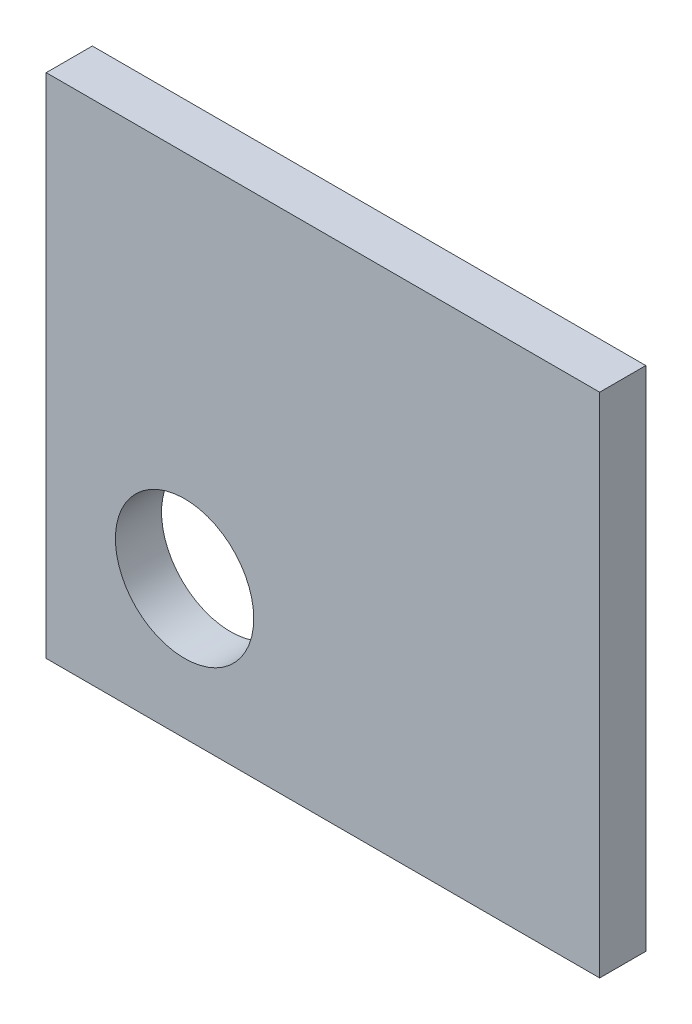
ISO-10303-21;
HEADER;
FILE_DESCRIPTION(('STEP AP214'),'2;1');
FILE_NAME('part.step','',(''),(''),'','','');
FILE_SCHEMA(('AUTOMOTIVE_DESIGN { 1 0 10303 214 1 1 1 1 }'));
ENDSEC;
DATA;
#1=APPLICATION_CONTEXT('core data for automotive mechanical design processes');
#2=APPLICATION_PROTOCOL_DEFINITION('international standard','automotive_design',2000,#1);
#3=PRODUCT_CONTEXT('',#1,'mechanical');
#4=PRODUCT('Part','Part','',(#3));
#5=PRODUCT_RELATED_PRODUCT_CATEGORY('part','',(#4));
#6=PRODUCT_DEFINITION_FORMATION('','',#4);
#7=PRODUCT_DEFINITION_CONTEXT('part definition',#1,'design');
#8=PRODUCT_DEFINITION('design','',#6,#7);
#9=PRODUCT_DEFINITION_SHAPE('','',#8);
#10=(LENGTH_UNIT() NAMED_UNIT(*) SI_UNIT(.MILLI.,.METRE.));
#11=(NAMED_UNIT(*) PLANE_ANGLE_UNIT() SI_UNIT($,.RADIAN.));
#12=(NAMED_UNIT(*) SI_UNIT($,.STERADIAN.) SOLID_ANGLE_UNIT());
#13=UNCERTAINTY_MEASURE_WITH_UNIT(LENGTH_MEASURE(1.E-05),#10,'distance_accuracy_value','');
#14=(GEOMETRIC_REPRESENTATION_CONTEXT(3) GLOBAL_UNCERTAINTY_ASSIGNED_CONTEXT((#13)) GLOBAL_UNIT_ASSIGNED_CONTEXT((#10,
#11,#12)) REPRESENTATION_CONTEXT('',''));
#15=CARTESIAN_POINT('',(0.,0.,0.));
#16=DIRECTION('',(0.,0.,1.));
#17=DIRECTION('',(1.,0.,0.));
#18=AXIS2_PLACEMENT_3D('',#15,#16,#17);
#19=CARTESIAN_POINT('',(0.,69.85,6.35));
#20=DIRECTION('',(0.,0.,-1.));
#21=DIRECTION('',(-1.,0.,0.));
#22=AXIS2_PLACEMENT_3D('',#19,#20,#21);
#23=PLANE('',#22);
#24=DIRECTION('',(0.,-1.,0.));
#25=VECTOR('',#24,1.);
#26=CARTESIAN_POINT('',(0.,0.,6.35));
#27=LINE('',#26,#25);
#28=CARTESIAN_POINT('',(0.,69.85,6.35));
#29=VERTEX_POINT('',#28);
#30=CARTESIAN_POINT('',(0.,0.,6.35));
#31=VERTEX_POINT('',#30);
#32=EDGE_CURVE('E97',#29,#31,#27,.T.);
#33=ORIENTED_EDGE('',*,*,#32,.T.);
#34=DIRECTION('',(1.,0.,0.));
#35=VECTOR('',#34,1.);
#36=CARTESIAN_POINT('',(0.,0.,6.35));
#37=LINE('',#36,#35);
#38=CARTESIAN_POINT('',(76.2,0.,6.35));
#39=VERTEX_POINT('',#38);
#40=EDGE_CURVE('E82',#31,#39,#37,.T.);
#41=ORIENTED_EDGE('',*,*,#40,.T.);
#42=DIRECTION('',(0.,1.,0.));
#43=VECTOR('',#42,1.);
#44=CARTESIAN_POINT('',(76.2,0.,6.35));
#45=LINE('',#44,#43);
#46=CARTESIAN_POINT('',(76.2,69.85,6.35));
#47=VERTEX_POINT('',#46);
#48=EDGE_CURVE('E48',#39,#47,#45,.T.);
#49=ORIENTED_EDGE('',*,*,#48,.T.);
#50=DIRECTION('',(-1.,0.,0.));
#51=VECTOR('',#50,1.);
#52=CARTESIAN_POINT('',(0.,69.85,6.35));
#53=LINE('',#52,#51);
#54=EDGE_CURVE('E43',#47,#29,#53,.T.);
#55=ORIENTED_EDGE('',*,*,#54,.T.);
#56=EDGE_LOOP('',(#33,#41,#49,#55));
#57=FACE_BOUND('',#56,.T.);
#58=CARTESIAN_POINT('',(19.05,19.05,6.35));
#59=DIRECTION('',(0.,0.,1.));
#60=DIRECTION('',(1.,0.,0.));
#61=AXIS2_PLACEMENT_3D('',#58,#59,#60);
#62=CIRCLE('',#61,9.525);
#63=CARTESIAN_POINT('',(28.575,19.05,6.35));
#64=VERTEX_POINT('',#63);
#65=EDGE_CURVE('E87',#64,#64,#62,.T.);
#66=ORIENTED_EDGE('',*,*,#65,.F.);
#67=EDGE_LOOP('',(#66));
#68=FACE_BOUND('',#67,.T.);
#69=ADVANCED_FACE('F28',(#57,#68),#23,.F.);
#70=CARTESIAN_POINT('',(0.,69.85,0.));
#71=DIRECTION('',(0.,0.,-1.));
#72=DIRECTION('',(-1.,0.,0.));
#73=AXIS2_PLACEMENT_3D('',#70,#71,#72);
#74=PLANE('',#73);
#75=DIRECTION('',(0.,-1.,0.));
#76=VECTOR('',#75,1.);
#77=CARTESIAN_POINT('',(0.,0.,0.));
#78=LINE('',#77,#76);
#79=CARTESIAN_POINT('',(0.,69.85,0.));
#80=VERTEX_POINT('',#79);
#81=CARTESIAN_POINT('',(0.,0.,0.));
#82=VERTEX_POINT('',#81);
#83=EDGE_CURVE('E74',#80,#82,#78,.T.);
#84=ORIENTED_EDGE('',*,*,#83,.F.);
#85=DIRECTION('',(-1.,0.,0.));
#86=VECTOR('',#85,1.);
#87=CARTESIAN_POINT('',(0.,69.85,0.));
#88=LINE('',#87,#86);
#89=CARTESIAN_POINT('',(76.2,69.85,0.));
#90=VERTEX_POINT('',#89);
#91=EDGE_CURVE('E95',#90,#80,#88,.T.);
#92=ORIENTED_EDGE('',*,*,#91,.F.);
#93=DIRECTION('',(0.,1.,0.));
#94=VECTOR('',#93,1.);
#95=CARTESIAN_POINT('',(76.2,0.,0.));
#96=LINE('',#95,#94);
#97=CARTESIAN_POINT('',(76.2,0.,0.));
#98=VERTEX_POINT('',#97);
#99=EDGE_CURVE('E75',#98,#90,#96,.T.);
#100=ORIENTED_EDGE('',*,*,#99,.F.);
#101=DIRECTION('',(1.,0.,0.));
#102=VECTOR('',#101,1.);
#103=CARTESIAN_POINT('',(0.,0.,0.));
#104=LINE('',#103,#102);
#105=EDGE_CURVE('E69',#82,#98,#104,.T.);
#106=ORIENTED_EDGE('',*,*,#105,.F.);
#107=EDGE_LOOP('',(#84,#92,#100,#106));
#108=FACE_BOUND('',#107,.T.);
#109=CARTESIAN_POINT('',(19.05,19.05,0.));
#110=DIRECTION('',(0.,0.,1.));
#111=DIRECTION('',(1.,0.,0.));
#112=AXIS2_PLACEMENT_3D('',#109,#110,#111);
#113=CIRCLE('',#112,9.525);
#114=CARTESIAN_POINT('',(28.575,19.05,0.));
#115=VERTEX_POINT('',#114);
#116=EDGE_CURVE('E90',#115,#115,#113,.T.);
#117=ORIENTED_EDGE('',*,*,#116,.T.);
#118=EDGE_LOOP('',(#117));
#119=FACE_BOUND('',#118,.T.);
#120=ADVANCED_FACE('F70',(#108,#119),#74,.T.);
#121=CARTESIAN_POINT('',(0.,0.,6.35));
#122=DIRECTION('',(1.,0.,0.));
#123=DIRECTION('',(0.,0.,-1.));
#124=AXIS2_PLACEMENT_3D('',#121,#122,#123);
#125=PLANE('',#124);
#126=ORIENTED_EDGE('',*,*,#83,.T.);
#127=DIRECTION('',(0.,0.,-1.));
#128=VECTOR('',#127,1.);
#129=CARTESIAN_POINT('',(0.,0.,6.35));
#130=LINE('',#129,#128);
#131=EDGE_CURVE('E11',#31,#82,#130,.T.);
#132=ORIENTED_EDGE('',*,*,#131,.F.);
#133=ORIENTED_EDGE('',*,*,#32,.F.);
#134=DIRECTION('',(0.,0.,-1.));
#135=VECTOR('',#134,1.);
#136=CARTESIAN_POINT('',(0.,69.85,6.35));
#137=LINE('',#136,#135);
#138=EDGE_CURVE('E86',#29,#80,#137,.T.);
#139=ORIENTED_EDGE('',*,*,#138,.T.);
#140=EDGE_LOOP('',(#126,#132,#133,#139));
#141=FACE_BOUND('',#140,.T.);
#142=ADVANCED_FACE('F30',(#141),#125,.F.);
#143=CARTESIAN_POINT('',(0.,0.,6.35));
#144=DIRECTION('',(0.,1.,0.));
#145=DIRECTION('',(0.,0.,1.));
#146=AXIS2_PLACEMENT_3D('',#143,#144,#145);
#147=PLANE('',#146);
#148=ORIENTED_EDGE('',*,*,#105,.T.);
#149=DIRECTION('',(0.,0.,-1.));
#150=VECTOR('',#149,1.);
#151=CARTESIAN_POINT('',(76.2,0.,6.35));
#152=LINE('',#151,#150);
#153=EDGE_CURVE('E36',#39,#98,#152,.T.);
#154=ORIENTED_EDGE('',*,*,#153,.F.);
#155=ORIENTED_EDGE('',*,*,#40,.F.);
#156=ORIENTED_EDGE('',*,*,#131,.T.);
#157=EDGE_LOOP('',(#148,#154,#155,#156));
#158=FACE_BOUND('',#157,.T.);
#159=ADVANCED_FACE('F81',(#158),#147,.F.);
#160=CARTESIAN_POINT('',(76.2,0.,6.35));
#161=DIRECTION('',(-1.,0.,0.));
#162=DIRECTION('',(0.,0.,1.));
#163=AXIS2_PLACEMENT_3D('',#160,#161,#162);
#164=PLANE('',#163);
#165=ORIENTED_EDGE('',*,*,#99,.T.);
#166=DIRECTION('',(0.,0.,-1.));
#167=VECTOR('',#166,1.);
#168=CARTESIAN_POINT('',(76.2,69.85,6.35));
#169=LINE('',#168,#167);
#170=EDGE_CURVE('E103',#47,#90,#169,.T.);
#171=ORIENTED_EDGE('',*,*,#170,.F.);
#172=ORIENTED_EDGE('',*,*,#48,.F.);
#173=ORIENTED_EDGE('',*,*,#153,.T.);
#174=EDGE_LOOP('',(#165,#171,#172,#173));
#175=FACE_BOUND('',#174,.T.);
#176=ADVANCED_FACE('F106',(#175),#164,.F.);
#177=CARTESIAN_POINT('',(0.,69.85,6.35));
#178=DIRECTION('',(0.,-1.,0.));
#179=DIRECTION('',(0.,0.,-1.));
#180=AXIS2_PLACEMENT_3D('',#177,#178,#179);
#181=PLANE('',#180);
#182=ORIENTED_EDGE('',*,*,#91,.T.);
#183=ORIENTED_EDGE('',*,*,#138,.F.);
#184=ORIENTED_EDGE('',*,*,#54,.F.);
#185=ORIENTED_EDGE('',*,*,#170,.T.);
#186=EDGE_LOOP('',(#182,#183,#184,#185));
#187=FACE_BOUND('',#186,.T.);
#188=ADVANCED_FACE('F108',(#187),#181,.F.);
#189=CARTESIAN_POINT('',(19.05,19.05,6.35));
#190=DIRECTION('',(0.,0.,-1.));
#191=DIRECTION('',(-1.,0.,0.));
#192=AXIS2_PLACEMENT_3D('',#189,#190,#191);
#193=CYLINDRICAL_SURFACE('',#192,9.525);
#194=ORIENTED_EDGE('',*,*,#65,.T.);
#195=EDGE_LOOP('',(#194));
#196=FACE_BOUND('',#195,.T.);
#197=ORIENTED_EDGE('',*,*,#116,.F.);
#198=EDGE_LOOP('',(#197));
#199=FACE_BOUND('',#198,.T.);
#200=ADVANCED_FACE('F114',(#196,#199),#193,.F.);
#201=CLOSED_SHELL('',(#69,#120,#142,#159,#176,#188,#200));
#202=MANIFOLD_SOLID_BREP('B2',#201);
#203=ADVANCED_BREP_SHAPE_REPRESENTATION('',(#18,#202),#14);
#204=SHAPE_DEFINITION_REPRESENTATION(#9,#203);
ENDSEC;
END-ISO-10303-21;
